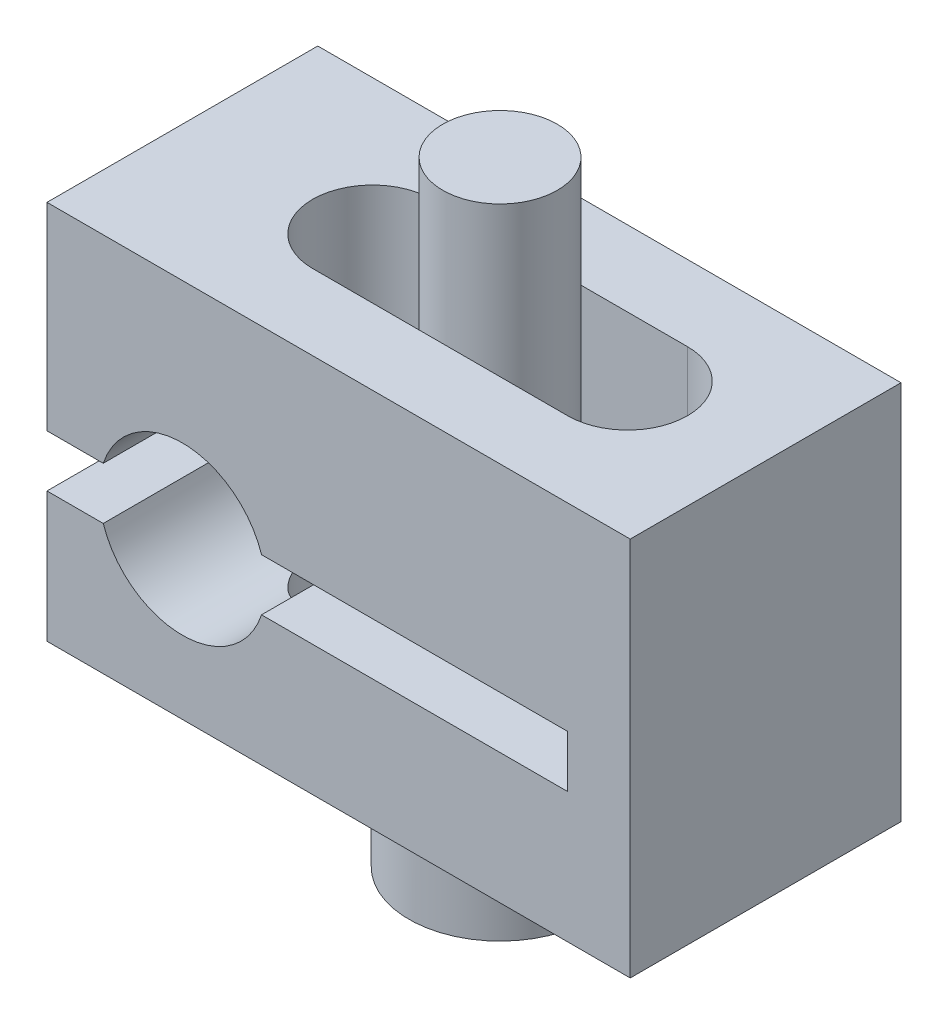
ISO-10303-21;
HEADER;
FILE_DESCRIPTION(('STEP AP214'),'2;1');
FILE_NAME('part.step','',(''),(''),'','','');
FILE_SCHEMA(('AUTOMOTIVE_DESIGN { 1 0 10303 214 1 1 1 1 }'));
ENDSEC;
DATA;
#1=APPLICATION_CONTEXT('core data for automotive mechanical design processes');
#2=APPLICATION_PROTOCOL_DEFINITION('international standard','automotive_design',2000,#1);
#3=PRODUCT_CONTEXT('',#1,'mechanical');
#4=PRODUCT('Part','Part','',(#3));
#5=PRODUCT_RELATED_PRODUCT_CATEGORY('part','',(#4));
#6=PRODUCT_DEFINITION_FORMATION('','',#4);
#7=PRODUCT_DEFINITION_CONTEXT('part definition',#1,'design');
#8=PRODUCT_DEFINITION('design','',#6,#7);
#9=PRODUCT_DEFINITION_SHAPE('','',#8);
#10=(LENGTH_UNIT() NAMED_UNIT(*) SI_UNIT(.MILLI.,.METRE.));
#11=(NAMED_UNIT(*) PLANE_ANGLE_UNIT() SI_UNIT($,.RADIAN.));
#12=(NAMED_UNIT(*) SI_UNIT($,.STERADIAN.) SOLID_ANGLE_UNIT());
#13=UNCERTAINTY_MEASURE_WITH_UNIT(LENGTH_MEASURE(1.E-05),#10,'distance_accuracy_value','');
#14=(GEOMETRIC_REPRESENTATION_CONTEXT(3) GLOBAL_UNCERTAINTY_ASSIGNED_CONTEXT((#13)) GLOBAL_UNIT_ASSIGNED_CONTEXT((#10,
#11,#12)) REPRESENTATION_CONTEXT('',''));
#15=CARTESIAN_POINT('',(0.,0.,0.));
#16=DIRECTION('',(0.,0.,1.));
#17=DIRECTION('',(1.,0.,0.));
#18=AXIS2_PLACEMENT_3D('',#15,#16,#17);
#19=CARTESIAN_POINT('',(0.634999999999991,-5.96900000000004,0.));
#20=DIRECTION('',(0.,1.,0.));
#21=DIRECTION('',(0.,0.,1.));
#22=AXIS2_PLACEMENT_3D('',#19,#20,#21);
#23=PLANE('',#22);
#24=DIRECTION('',(1.,0.,0.));
#25=VECTOR('',#24,1.);
#26=CARTESIAN_POINT('',(1.26999999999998,-5.96900000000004,1.09985226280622));
#27=LINE('',#26,#25);
#28=CARTESIAN_POINT('',(1.26999999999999,-5.96900000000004,1.09985226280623));
#29=VERTEX_POINT('',#28);
#30=CARTESIAN_POINT('',(0.,-5.96900000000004,1.09985226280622));
#31=VERTEX_POINT('',#30);
#32=EDGE_CURVE('E300',#29,#31,#27,.F.);
#33=ORIENTED_EDGE('',*,*,#32,.T.);
#34=DIRECTION('',(0.500000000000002,0.,0.866025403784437));
#35=VECTOR('',#34,1.);
#36=CARTESIAN_POINT('',(0.,-5.96900000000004,1.09985226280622));
#37=LINE('',#36,#35);
#38=CARTESIAN_POINT('',(-0.634999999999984,-5.96900000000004,0.));
#39=VERTEX_POINT('',#38);
#40=EDGE_CURVE('E630',#31,#39,#37,.F.);
#41=ORIENTED_EDGE('',*,*,#40,.T.);
#42=DIRECTION('',(-0.5,0.,0.866025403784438));
#43=VECTOR('',#42,1.);
#44=CARTESIAN_POINT('',(-0.634999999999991,-5.96900000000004,0.));
#45=LINE('',#44,#43);
#46=CARTESIAN_POINT('',(0.,-5.96900000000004,-1.09985226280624));
#47=VERTEX_POINT('',#46);
#48=EDGE_CURVE('E625',#39,#47,#45,.F.);
#49=ORIENTED_EDGE('',*,*,#48,.T.);
#50=DIRECTION('',(-1.,0.,0.));
#51=VECTOR('',#50,1.);
#52=CARTESIAN_POINT('',(0.,-5.96900000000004,-1.09985226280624));
#53=LINE('',#52,#51);
#54=CARTESIAN_POINT('',(1.26999999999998,-5.96900000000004,-1.09985226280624));
#55=VERTEX_POINT('',#54);
#56=EDGE_CURVE('E620',#47,#55,#53,.F.);
#57=ORIENTED_EDGE('',*,*,#56,.T.);
#58=DIRECTION('',(-0.500000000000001,0.,-0.866025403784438));
#59=VECTOR('',#58,1.);
#60=CARTESIAN_POINT('',(1.26999999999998,-5.96900000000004,-1.09985226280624));
#61=LINE('',#60,#59);
#62=CARTESIAN_POINT('',(1.90499999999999,-5.96900000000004,0.));
#63=VERTEX_POINT('',#62);
#64=EDGE_CURVE('E150',#55,#63,#61,.F.);
#65=ORIENTED_EDGE('',*,*,#64,.T.);
#66=DIRECTION('',(0.5,0.,-0.866025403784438));
#67=VECTOR('',#66,1.);
#68=CARTESIAN_POINT('',(1.905,-5.96900000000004,0.));
#69=LINE('',#68,#67);
#70=EDGE_CURVE('E615',#63,#29,#69,.F.);
#71=ORIENTED_EDGE('',*,*,#70,.T.);
#72=EDGE_LOOP('',(#33,#41,#49,#57,#65,#71));
#73=FACE_BOUND('',#72,.T.);
#74=ADVANCED_FACE('F17',(#73),#23,.F.);
#75=CARTESIAN_POINT('',(0.50800000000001,7.49299999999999,0.));
#76=DIRECTION('',(0.,1.,0.));
#77=DIRECTION('',(0.,0.,1.));
#78=AXIS2_PLACEMENT_3D('',#75,#76,#77);
#79=PLANE('',#78);
#80=CARTESIAN_POINT('',(0.634999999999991,7.49299999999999,0.));
#81=DIRECTION('',(0.,-1.,0.));
#82=DIRECTION('',(0.,0.,-1.));
#83=AXIS2_PLACEMENT_3D('',#80,#81,#82);
#84=CIRCLE('',#83,1.397);
#85=CARTESIAN_POINT('',(0.634999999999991,7.49299999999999,-1.39699999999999));
#86=VERTEX_POINT('',#85);
#87=EDGE_CURVE('E22',#86,#86,#84,.T.);
#88=ORIENTED_EDGE('',*,*,#87,.F.);
#89=EDGE_LOOP('',(#88));
#90=FACE_BOUND('',#89,.T.);
#91=ADVANCED_FACE('F811',(#90),#79,.T.);
#92=CARTESIAN_POINT('',(-2.47649999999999,4.318,1.4605));
#93=DIRECTION('',(0.,0.,1.));
#94=DIRECTION('',(1.,0.,0.));
#95=AXIS2_PLACEMENT_3D('',#92,#93,#94);
#96=PLANE('',#95);
#97=CARTESIAN_POINT('',(-3.80999999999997,-1.14300000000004,1.4605));
#98=DIRECTION('',(0.,0.,-1.));
#99=DIRECTION('',(0.,1.,0.));
#100=AXIS2_PLACEMENT_3D('',#97,#98,#99);
#101=CIRCLE('',#100,2.032);
#102=CARTESIAN_POINT('',(-1.87976711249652,-0.507999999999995,1.4605));
#103=VERTEX_POINT('',#102);
#104=CARTESIAN_POINT('',(-2.47649999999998,0.390232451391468,1.4605));
#105=VERTEX_POINT('',#104);
#106=EDGE_CURVE('E403',#103,#105,#101,.F.);
#107=ORIENTED_EDGE('',*,*,#106,.T.);
#108=DIRECTION('',(0.,-1.,0.));
#109=VECTOR('',#108,1.);
#110=CARTESIAN_POINT('',(-2.47649999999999,4.318,1.46050000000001));
#111=LINE('',#110,#109);
#112=CARTESIAN_POINT('',(-2.47649999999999,4.318,1.46050000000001));
#113=VERTEX_POINT('',#112);
#114=EDGE_CURVE('E303',#105,#113,#111,.F.);
#115=ORIENTED_EDGE('',*,*,#114,.T.);
#116=DIRECTION('',(1.,0.,0.));
#117=VECTOR('',#116,1.);
#118=CARTESIAN_POINT('',(7.11199999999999,4.318,1.4605));
#119=LINE('',#118,#117);
#120=CARTESIAN_POINT('',(3.7465,4.318,1.46050000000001));
#121=VERTEX_POINT('',#120);
#122=EDGE_CURVE('E289',#121,#113,#119,.F.);
#123=ORIENTED_EDGE('',*,*,#122,.F.);
#124=DIRECTION('',(0.,-1.,0.));
#125=VECTOR('',#124,1.);
#126=CARTESIAN_POINT('',(3.7465,4.318,1.46050000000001));
#127=LINE('',#126,#125);
#128=CARTESIAN_POINT('',(3.7465,-0.507999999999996,1.4605));
#129=VERTEX_POINT('',#128);
#130=EDGE_CURVE('E297',#121,#129,#127,.T.);
#131=ORIENTED_EDGE('',*,*,#130,.T.);
#132=DIRECTION('',(1.,0.,0.));
#133=VECTOR('',#132,1.);
#134=CARTESIAN_POINT('',(-1.87976711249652,-0.507999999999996,1.4605));
#135=LINE('',#134,#133);
#136=EDGE_CURVE('E543',#103,#129,#135,.T.);
#137=ORIENTED_EDGE('',*,*,#136,.F.);
#138=EDGE_LOOP('',(#107,#115,#123,#131,#137));
#139=FACE_BOUND('',#138,.T.);
#140=ADVANCED_FACE('F603',(#139),#96,.F.);
#141=CARTESIAN_POINT('',(-2.47649999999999,4.318,0.));
#142=DIRECTION('',(0.,-1.,0.));
#143=DIRECTION('',(0.,0.,-1.));
#144=AXIS2_PLACEMENT_3D('',#141,#142,#143);
#145=CYLINDRICAL_SURFACE('',#144,1.4605);
#146=CARTESIAN_POINT('',(-2.47649999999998,0.390232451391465,1.46050000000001));
#147=CARTESIAN_POINT('',(-2.50555463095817,0.415509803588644,1.46050207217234));
#148=CARTESIAN_POINT('',(-2.53534390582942,0.439959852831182,1.45963267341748));
#149=CARTESIAN_POINT('',(-2.59620579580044,0.487093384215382,1.45590518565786));
#150=CARTESIAN_POINT('',(-2.62727943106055,0.509775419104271,1.45304548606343));
#151=CARTESIAN_POINT('',(-2.69055768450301,0.553275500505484,1.44508061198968));
#152=CARTESIAN_POINT('',(-2.7227650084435,0.574088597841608,1.439969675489));
#153=CARTESIAN_POINT('',(-2.78792788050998,0.61365858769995,1.42729725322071));
#154=CARTESIAN_POINT('',(-2.820883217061,0.632416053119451,1.41973645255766));
#155=CARTESIAN_POINT('',(-2.92077758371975,0.685657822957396,1.39299130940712));
#156=CARTESIAN_POINT('',(-2.98845267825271,0.716912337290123,1.36977657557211));
#157=CARTESIAN_POINT('',(-3.1222658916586,0.770437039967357,1.31200058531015));
#158=CARTESIAN_POINT('',(-3.18840724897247,0.792728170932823,1.27746612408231));
#159=CARTESIAN_POINT('',(-3.31096528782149,0.827717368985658,1.20063972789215));
#160=CARTESIAN_POINT('',(-3.3677364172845,0.841041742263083,1.15919277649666));
#161=CARTESIAN_POINT('',(-3.47531586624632,0.861999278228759,1.06790025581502));
#162=CARTESIAN_POINT('',(-3.52611851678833,0.869627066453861,1.01804680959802));
#163=CARTESIAN_POINT('',(-3.6213233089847,0.880805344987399,0.909819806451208));
#164=CARTESIAN_POINT('',(-3.66552285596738,0.884243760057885,0.851257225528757));
#165=CARTESIAN_POINT('',(-3.74469371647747,0.888338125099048,0.728086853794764));
#166=CARTESIAN_POINT('',(-3.77965984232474,0.888992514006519,0.663475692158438));
#167=CARTESIAN_POINT('',(-3.84207606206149,0.889008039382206,0.524012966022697));
#168=CARTESIAN_POINT('',(-3.868625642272,0.888253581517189,0.448758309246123));
#169=CARTESIAN_POINT('',(-3.90908942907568,0.886684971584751,0.295033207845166));
#170=CARTESIAN_POINT('',(-3.92302794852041,0.88587093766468,0.21656925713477));
#171=CARTESIAN_POINT('',(-3.93266911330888,0.885294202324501,0.114724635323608));
#172=CARTESIAN_POINT('',(-3.93429216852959,0.8851954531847,0.0918120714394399));
#173=CARTESIAN_POINT('',(-3.93645805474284,0.885061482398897,0.0459363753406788));
#174=CARTESIAN_POINT('',(-3.93700090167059,0.885026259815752,0.0229732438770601));
#175=CARTESIAN_POINT('',(-3.93699678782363,0.885031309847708,-0.0818370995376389));
#176=CARTESIAN_POINT('',(-3.93009275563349,0.885496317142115,-0.16379125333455));
#177=CARTESIAN_POINT('',(-3.90263419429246,0.886932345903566,-0.325508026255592));
#178=CARTESIAN_POINT('',(-3.88204779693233,0.887904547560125,-0.405265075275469));
#179=CARTESIAN_POINT('',(-3.82779059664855,0.889102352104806,-0.560179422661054));
#180=CARTESIAN_POINT('',(-3.79412638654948,0.889328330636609,-0.635339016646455));
#181=CARTESIAN_POINT('',(-3.71468713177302,0.887150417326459,-0.778895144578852));
#182=CARTESIAN_POINT('',(-3.66891788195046,0.884747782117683,-0.847294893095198));
#183=CARTESIAN_POINT('',(-3.56747671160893,0.875107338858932,-0.974339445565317));
#184=CARTESIAN_POINT('',(-3.51195828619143,0.867940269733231,-1.03311151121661));
#185=CARTESIAN_POINT('',(-3.3927568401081,0.846617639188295,-1.14014620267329));
#186=CARTESIAN_POINT('',(-3.32908137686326,0.832468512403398,-1.18841844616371));
#187=CARTESIAN_POINT('',(-3.20191282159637,0.796910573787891,-1.26967310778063));
#188=CARTESIAN_POINT('',(-3.13881598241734,0.776176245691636,-1.30357226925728));
#189=CARTESIAN_POINT('',(-3.01107667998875,0.726607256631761,-1.36095188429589));
#190=CARTESIAN_POINT('',(-2.94643403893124,0.697771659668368,-1.38443113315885));
#191=CARTESIAN_POINT('',(-2.82126685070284,0.633560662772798,-1.42065551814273));
#192=CARTESIAN_POINT('',(-2.76068635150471,0.598529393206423,-1.43382802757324));
#193=CARTESIAN_POINT('',(-2.64274771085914,0.521778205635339,-1.45223333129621));
#194=CARTESIAN_POINT('',(-2.5853866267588,0.480064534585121,-1.45747349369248));
#195=CARTESIAN_POINT('',(-2.51213255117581,0.4206888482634,-1.46017998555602));
#196=CARTESIAN_POINT('',(-2.4941761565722,0.405611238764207,-1.4605018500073));
#197=CARTESIAN_POINT('',(-2.47649999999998,0.390232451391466,-1.46049999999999));
#198=B_SPLINE_CURVE_WITH_KNOTS('',3,(#146,#147,#148,#149,#150,#151,#152,#153,#154,#155,#156,
#157,#158,#159,#160,#161,#162,#163,#164,#165,#166,#167,#168,#169,#170,#171,#172,#173,#174,#175,
#176,#177,#178,#179,#180,#181,#182,#183,#184,#185,#186,#187,#188,#189,#190,#191,#192,#193,#194,
#195,#196,#197),.UNSPECIFIED.,.F.,.F.,(4,2,2,2,2,2,2,2,2,2,2,2,2,2,2,2,2,2,2,2,2,2,2,2,2,4),(0.,
0.115524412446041,0.231142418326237,0.34705808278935,0.462941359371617,0.695758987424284,
0.928029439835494,1.14165945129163,1.35549075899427,1.57492511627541,1.79448249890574,
2.03284914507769,2.27075525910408,2.33964860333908,2.40854093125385,2.65396781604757,
2.8999683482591,3.14584502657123,3.39160421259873,3.63379368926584,3.87576038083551,
4.09828962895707,4.3208445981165,4.53359358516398,4.74614483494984,4.81646215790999),.UNSPECIFIED.);
#199=CARTESIAN_POINT('',(-2.47649999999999,0.390232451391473,-1.4605));
#200=VERTEX_POINT('',#199);
#201=EDGE_CURVE('E226',#105,#200,#198,.T.);
#202=ORIENTED_EDGE('',*,*,#201,.T.);
#203=DIRECTION('',(0.,1.,0.));
#204=VECTOR('',#203,1.);
#205=CARTESIAN_POINT('',(-2.47649999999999,4.318,-1.4605));
#206=LINE('',#205,#204);
#207=CARTESIAN_POINT('',(-2.47649999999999,4.318,-1.46049999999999));
#208=VERTEX_POINT('',#207);
#209=EDGE_CURVE('E302',#200,#208,#206,.T.);
#210=ORIENTED_EDGE('',*,*,#209,.T.);
#211=CARTESIAN_POINT('',(-2.47649999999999,4.318,0.));
#212=DIRECTION('',(0.,-1.,0.));
#213=DIRECTION('',(0.,0.,-1.));
#214=AXIS2_PLACEMENT_3D('',#211,#212,#213);
#215=CIRCLE('',#214,1.4605);
#216=EDGE_CURVE('E418',#113,#208,#215,.T.);
#217=ORIENTED_EDGE('',*,*,#216,.F.);
#218=ORIENTED_EDGE('',*,*,#114,.F.);
#219=EDGE_LOOP('',(#202,#210,#217,#218));
#220=FACE_BOUND('',#219,.T.);
#221=ADVANCED_FACE('F428',(#220),#145,.F.);
#222=CARTESIAN_POINT('',(3.7465,4.318,-1.4605));
#223=DIRECTION('',(0.,0.,-1.));
#224=DIRECTION('',(-1.,0.,0.));
#225=AXIS2_PLACEMENT_3D('',#222,#223,#224);
#226=PLANE('',#225);
#227=DIRECTION('',(0.,-1.,0.));
#228=VECTOR('',#227,1.);
#229=CARTESIAN_POINT('',(3.7465,4.318,-1.46049999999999));
#230=LINE('',#229,#228);
#231=CARTESIAN_POINT('',(3.7465,-0.507999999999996,-1.4605));
#232=VERTEX_POINT('',#231);
#233=CARTESIAN_POINT('',(3.7465,4.318,-1.46049999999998));
#234=VERTEX_POINT('',#233);
#235=EDGE_CURVE('E138',#232,#234,#230,.F.);
#236=ORIENTED_EDGE('',*,*,#235,.T.);
#237=DIRECTION('',(1.,0.,0.));
#238=VECTOR('',#237,1.);
#239=CARTESIAN_POINT('',(7.11199999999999,4.318,-1.46049999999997));
#240=LINE('',#239,#238);
#241=EDGE_CURVE('E532',#208,#234,#240,.T.);
#242=ORIENTED_EDGE('',*,*,#241,.F.);
#243=ORIENTED_EDGE('',*,*,#209,.F.);
#244=CARTESIAN_POINT('',(-3.80999999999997,-1.14300000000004,-1.46049999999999));
#245=DIRECTION('',(0.,0.,-1.));
#246=DIRECTION('',(0.,1.,0.));
#247=AXIS2_PLACEMENT_3D('',#244,#245,#246);
#248=CIRCLE('',#247,2.032);
#249=CARTESIAN_POINT('',(-1.87976711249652,-0.507999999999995,-1.4605));
#250=VERTEX_POINT('',#249);
#251=EDGE_CURVE('E276',#200,#250,#248,.T.);
#252=ORIENTED_EDGE('',*,*,#251,.T.);
#253=DIRECTION('',(1.,0.,0.));
#254=VECTOR('',#253,1.);
#255=CARTESIAN_POINT('',(-1.87976711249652,-0.507999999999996,-1.46050000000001));
#256=LINE('',#255,#254);
#257=EDGE_CURVE('E227',#232,#250,#256,.F.);
#258=ORIENTED_EDGE('',*,*,#257,.F.);
#259=EDGE_LOOP('',(#236,#242,#243,#252,#258));
#260=FACE_BOUND('',#259,.T.);
#261=ADVANCED_FACE('F606',(#260),#226,.F.);
#262=CARTESIAN_POINT('',(3.7465,4.318,0.));
#263=DIRECTION('',(0.,-1.,0.));
#264=DIRECTION('',(0.,0.,-1.));
#265=AXIS2_PLACEMENT_3D('',#262,#263,#264);
#266=CYLINDRICAL_SURFACE('',#265,1.4605);
#267=CARTESIAN_POINT('',(3.7465,-0.507999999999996,0.));
#268=DIRECTION('',(0.,-1.,0.));
#269=DIRECTION('',(0.,0.,-1.));
#270=AXIS2_PLACEMENT_3D('',#267,#268,#269);
#271=CIRCLE('',#270,1.4605);
#272=EDGE_CURVE('E141',#129,#232,#271,.F.);
#273=ORIENTED_EDGE('',*,*,#272,.F.);
#274=ORIENTED_EDGE('',*,*,#130,.F.);
#275=CARTESIAN_POINT('',(3.7465,4.318,0.));
#276=DIRECTION('',(0.,-1.,0.));
#277=DIRECTION('',(0.,0.,-1.));
#278=AXIS2_PLACEMENT_3D('',#275,#276,#277);
#279=CIRCLE('',#278,1.4605);
#280=EDGE_CURVE('E529',#234,#121,#279,.T.);
#281=ORIENTED_EDGE('',*,*,#280,.F.);
#282=ORIENTED_EDGE('',*,*,#235,.F.);
#283=EDGE_LOOP('',(#273,#274,#281,#282));
#284=FACE_BOUND('',#283,.T.);
#285=ADVANCED_FACE('F850',(#284),#266,.F.);
#286=CARTESIAN_POINT('',(1.26999999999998,-7.49299999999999,1.09985226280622));
#287=DIRECTION('',(0.,0.,1.));
#288=DIRECTION('',(1.,0.,0.));
#289=AXIS2_PLACEMENT_3D('',#286,#287,#288);
#290=PLANE('',#289);
#291=DIRECTION('',(0.,1.,0.));
#292=VECTOR('',#291,1.);
#293=CARTESIAN_POINT('',(1.27,-7.49299999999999,1.09985226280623));
#294=LINE('',#293,#292);
#295=CARTESIAN_POINT('',(1.26999999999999,-7.49299999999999,1.09985226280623));
#296=VERTEX_POINT('',#295);
#297=EDGE_CURVE('E609',#29,#296,#294,.F.);
#298=ORIENTED_EDGE('',*,*,#297,.T.);
#299=DIRECTION('',(1.,0.,0.));
#300=VECTOR('',#299,1.);
#301=CARTESIAN_POINT('',(0.432954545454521,-7.49299999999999,1.09985226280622));
#302=LINE('',#301,#300);
#303=CARTESIAN_POINT('',(0.,-7.49299999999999,1.09985226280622));
#304=VERTEX_POINT('',#303);
#305=EDGE_CURVE('E531',#296,#304,#302,.F.);
#306=ORIENTED_EDGE('',*,*,#305,.T.);
#307=DIRECTION('',(0.,1.,0.));
#308=VECTOR('',#307,1.);
#309=CARTESIAN_POINT('',(0.,-7.49299999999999,1.09985226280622));
#310=LINE('',#309,#308);
#311=EDGE_CURVE('E633',#304,#31,#310,.T.);
#312=ORIENTED_EDGE('',*,*,#311,.T.);
#313=ORIENTED_EDGE('',*,*,#32,.F.);
#314=EDGE_LOOP('',(#298,#306,#312,#313));
#315=FACE_BOUND('',#314,.T.);
#316=ADVANCED_FACE('F649',(#315),#290,.F.);
#317=CARTESIAN_POINT('',(0.,-7.49299999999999,1.09985226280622));
#318=DIRECTION('',(-0.866025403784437,0.,0.500000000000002));
#319=DIRECTION('',(0.500000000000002,0.,0.866025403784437));
#320=AXIS2_PLACEMENT_3D('',#317,#318,#319);
#321=PLANE('',#320);
#322=ORIENTED_EDGE('',*,*,#311,.F.);
#323=DIRECTION('',(-0.500000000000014,0.,-0.866025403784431));
#324=VECTOR('',#323,1.);
#325=CARTESIAN_POINT('',(0.,-7.49299999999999,1.09985226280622));
#326=LINE('',#325,#324);
#327=CARTESIAN_POINT('',(-0.634999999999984,-7.49299999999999,0.));
#328=VERTEX_POINT('',#327);
#329=EDGE_CURVE('E537',#304,#328,#326,.T.);
#330=ORIENTED_EDGE('',*,*,#329,.T.);
#331=DIRECTION('',(0.,1.,0.));
#332=VECTOR('',#331,1.);
#333=CARTESIAN_POINT('',(-0.634999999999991,-7.49299999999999,0.));
#334=LINE('',#333,#332);
#335=EDGE_CURVE('E627',#328,#39,#334,.T.);
#336=ORIENTED_EDGE('',*,*,#335,.T.);
#337=ORIENTED_EDGE('',*,*,#40,.F.);
#338=EDGE_LOOP('',(#322,#330,#336,#337));
#339=FACE_BOUND('',#338,.T.);
#340=ADVANCED_FACE('F647',(#339),#321,.F.);
#341=CARTESIAN_POINT('',(-0.634999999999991,-7.49299999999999,0.));
#342=DIRECTION('',(-0.866025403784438,0.,-0.5));
#343=DIRECTION('',(-0.5,0.,0.866025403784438));
#344=AXIS2_PLACEMENT_3D('',#341,#342,#343);
#345=PLANE('',#344);
#346=ORIENTED_EDGE('',*,*,#335,.F.);
#347=DIRECTION('',(0.500000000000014,0.,-0.866025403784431));
#348=VECTOR('',#347,1.);
#349=CARTESIAN_POINT('',(-0.634999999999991,-7.49299999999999,0.));
#350=LINE('',#349,#348);
#351=CARTESIAN_POINT('',(0.,-7.49299999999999,-1.09985226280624));
#352=VERTEX_POINT('',#351);
#353=EDGE_CURVE('E554',#328,#352,#350,.T.);
#354=ORIENTED_EDGE('',*,*,#353,.T.);
#355=DIRECTION('',(0.,1.,0.));
#356=VECTOR('',#355,1.);
#357=CARTESIAN_POINT('',(0.,-7.49299999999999,-1.09985226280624));
#358=LINE('',#357,#356);
#359=EDGE_CURVE('E622',#352,#47,#358,.T.);
#360=ORIENTED_EDGE('',*,*,#359,.T.);
#361=ORIENTED_EDGE('',*,*,#48,.F.);
#362=EDGE_LOOP('',(#346,#354,#360,#361));
#363=FACE_BOUND('',#362,.T.);
#364=ADVANCED_FACE('F656',(#363),#345,.F.);
#365=CARTESIAN_POINT('',(0.,-7.49299999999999,-1.09985226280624));
#366=DIRECTION('',(0.,0.,-1.));
#367=DIRECTION('',(-1.,0.,0.));
#368=AXIS2_PLACEMENT_3D('',#365,#366,#367);
#369=PLANE('',#368);
#370=ORIENTED_EDGE('',*,*,#359,.F.);
#371=DIRECTION('',(1.,0.,0.));
#372=VECTOR('',#371,1.);
#373=CARTESIAN_POINT('',(0.432954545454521,-7.49299999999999,-1.09985226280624));
#374=LINE('',#373,#372);
#375=CARTESIAN_POINT('',(1.26999999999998,-7.49299999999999,-1.09985226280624));
#376=VERTEX_POINT('',#375);
#377=EDGE_CURVE('E551',#352,#376,#374,.T.);
#378=ORIENTED_EDGE('',*,*,#377,.T.);
#379=DIRECTION('',(0.,1.,0.));
#380=VECTOR('',#379,1.);
#381=CARTESIAN_POINT('',(1.26999999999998,-7.49299999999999,-1.09985226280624));
#382=LINE('',#381,#380);
#383=EDGE_CURVE('E617',#376,#55,#382,.T.);
#384=ORIENTED_EDGE('',*,*,#383,.T.);
#385=ORIENTED_EDGE('',*,*,#56,.F.);
#386=EDGE_LOOP('',(#370,#378,#384,#385));
#387=FACE_BOUND('',#386,.T.);
#388=ADVANCED_FACE('F661',(#387),#369,.F.);
#389=CARTESIAN_POINT('',(1.26999999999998,-7.49299999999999,-1.09985226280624));
#390=DIRECTION('',(0.866025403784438,0.,-0.500000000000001));
#391=DIRECTION('',(-0.500000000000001,0.,-0.866025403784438));
#392=AXIS2_PLACEMENT_3D('',#389,#390,#391);
#393=PLANE('',#392);
#394=ORIENTED_EDGE('',*,*,#383,.F.);
#395=DIRECTION('',(0.500000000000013,0.,0.866025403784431));
#396=VECTOR('',#395,1.);
#397=CARTESIAN_POINT('',(1.26999999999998,-7.49299999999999,-1.09985226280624));
#398=LINE('',#397,#396);
#399=CARTESIAN_POINT('',(1.90499999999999,-7.49299999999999,0.));
#400=VERTEX_POINT('',#399);
#401=EDGE_CURVE('E548',#376,#400,#398,.T.);
#402=ORIENTED_EDGE('',*,*,#401,.T.);
#403=DIRECTION('',(0.,1.,0.));
#404=VECTOR('',#403,1.);
#405=CARTESIAN_POINT('',(1.905,-7.49299999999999,0.));
#406=LINE('',#405,#404);
#407=EDGE_CURVE('E612',#400,#63,#406,.T.);
#408=ORIENTED_EDGE('',*,*,#407,.T.);
#409=ORIENTED_EDGE('',*,*,#64,.F.);
#410=EDGE_LOOP('',(#394,#402,#408,#409));
#411=FACE_BOUND('',#410,.T.);
#412=ADVANCED_FACE('F663',(#411),#393,.F.);
#413=CARTESIAN_POINT('',(1.905,-7.49299999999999,0.));
#414=DIRECTION('',(0.866025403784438,0.,0.5));
#415=DIRECTION('',(0.5,0.,-0.866025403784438));
#416=AXIS2_PLACEMENT_3D('',#413,#414,#415);
#417=PLANE('',#416);
#418=ORIENTED_EDGE('',*,*,#407,.F.);
#419=DIRECTION('',(-0.500000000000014,0.,0.866025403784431));
#420=VECTOR('',#419,1.);
#421=CARTESIAN_POINT('',(1.905,-7.49299999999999,0.));
#422=LINE('',#421,#420);
#423=EDGE_CURVE('E253',#400,#296,#422,.T.);
#424=ORIENTED_EDGE('',*,*,#423,.T.);
#425=ORIENTED_EDGE('',*,*,#297,.F.);
#426=ORIENTED_EDGE('',*,*,#70,.F.);
#427=EDGE_LOOP('',(#418,#424,#425,#426));
#428=FACE_BOUND('',#427,.T.);
#429=ADVANCED_FACE('F665',(#428),#417,.F.);
#430=CARTESIAN_POINT('',(0.634999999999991,7.49299999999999,0.));
#431=DIRECTION('',(0.,-1.,0.));
#432=DIRECTION('',(0.,0.,-1.));
#433=AXIS2_PLACEMENT_3D('',#430,#431,#432);
#434=CYLINDRICAL_SURFACE('',#433,1.397);
#435=ORIENTED_EDGE('',*,*,#87,.T.);
#436=EDGE_LOOP('',(#435));
#437=FACE_BOUND('',#436,.T.);
#438=CARTESIAN_POINT('',(0.634999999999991,-4.953,0.));
#439=DIRECTION('',(0.,-1.,0.));
#440=DIRECTION('',(0.,0.,-1.));
#441=AXIS2_PLACEMENT_3D('',#438,#439,#440);
#442=CIRCLE('',#441,1.397);
#443=CARTESIAN_POINT('',(0.634999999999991,-4.953,-1.397));
#444=VERTEX_POINT('',#443);
#445=EDGE_CURVE('E252',#444,#444,#442,.T.);
#446=ORIENTED_EDGE('',*,*,#445,.F.);
#447=EDGE_LOOP('',(#446));
#448=FACE_BOUND('',#447,.T.);
#449=ADVANCED_FACE('F667',(#437,#448),#434,.T.);
#450=CARTESIAN_POINT('',(5.58799999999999,-0.507999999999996,3.30199999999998));
#451=DIRECTION('',(-1.,0.,0.));
#452=DIRECTION('',(0.,0.,1.));
#453=AXIS2_PLACEMENT_3D('',#450,#451,#452);
#454=PLANE('',#453);
#455=DIRECTION('',(0.,1.,0.));
#456=VECTOR('',#455,1.);
#457=CARTESIAN_POINT('',(5.58799999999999,-0.624782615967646,3.30199999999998));
#458=LINE('',#457,#456);
#459=CARTESIAN_POINT('',(5.58799999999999,-1.77800000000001,3.30199999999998));
#460=VERTEX_POINT('',#459);
#461=CARTESIAN_POINT('',(5.58799999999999,-0.507999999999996,3.30199999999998));
#462=VERTEX_POINT('',#461);
#463=EDGE_CURVE('E234',#460,#462,#458,.T.);
#464=ORIENTED_EDGE('',*,*,#463,.T.);
#465=DIRECTION('',(0.,0.,-1.));
#466=VECTOR('',#465,1.);
#467=CARTESIAN_POINT('',(5.58799999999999,-0.507999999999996,3.30199999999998));
#468=LINE('',#467,#466);
#469=CARTESIAN_POINT('',(5.58799999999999,-0.507999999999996,-3.302));
#470=VERTEX_POINT('',#469);
#471=EDGE_CURVE('E216',#470,#462,#468,.F.);
#472=ORIENTED_EDGE('',*,*,#471,.F.);
#473=DIRECTION('',(0.,1.,0.));
#474=VECTOR('',#473,1.);
#475=CARTESIAN_POINT('',(5.58799999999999,-0.624782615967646,-3.302));
#476=LINE('',#475,#474);
#477=CARTESIAN_POINT('',(5.58799999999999,-1.77800000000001,-3.302));
#478=VERTEX_POINT('',#477);
#479=EDGE_CURVE('E277',#478,#470,#476,.T.);
#480=ORIENTED_EDGE('',*,*,#479,.F.);
#481=DIRECTION('',(0.,0.,1.));
#482=VECTOR('',#481,1.);
#483=CARTESIAN_POINT('',(5.58799999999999,-1.77800000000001,3.30199999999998));
#484=LINE('',#483,#482);
#485=EDGE_CURVE('E241',#460,#478,#484,.F.);
#486=ORIENTED_EDGE('',*,*,#485,.F.);
#487=EDGE_LOOP('',(#464,#472,#480,#486));
#488=FACE_BOUND('',#487,.T.);
#489=ADVANCED_FACE('F240',(#488),#454,.T.);
#490=CARTESIAN_POINT('',(-1.87976711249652,-0.507999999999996,3.30199999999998));
#491=DIRECTION('',(0.,-1.,0.));
#492=DIRECTION('',(0.,0.,-1.));
#493=AXIS2_PLACEMENT_3D('',#490,#491,#492);
#494=PLANE('',#493);
#495=DIRECTION('',(-1.,0.,0.));
#496=VECTOR('',#495,1.);
#497=CARTESIAN_POINT('',(-0.168472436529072,-0.507999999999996,3.30199999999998));
#498=LINE('',#497,#496);
#499=CARTESIAN_POINT('',(-1.87976711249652,-0.507999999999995,3.30199999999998));
#500=VERTEX_POINT('',#499);
#501=EDGE_CURVE('E220',#462,#500,#498,.T.);
#502=ORIENTED_EDGE('',*,*,#501,.T.);
#503=DIRECTION('',(0.,0.,-1.));
#504=VECTOR('',#503,1.);
#505=CARTESIAN_POINT('',(-1.87976711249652,-0.507999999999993,3.30199999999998));
#506=LINE('',#505,#504);
#507=EDGE_CURVE('E275',#500,#103,#506,.T.);
#508=ORIENTED_EDGE('',*,*,#507,.T.);
#509=ORIENTED_EDGE('',*,*,#136,.T.);
#510=ORIENTED_EDGE('',*,*,#272,.T.);
#511=ORIENTED_EDGE('',*,*,#257,.T.);
#512=DIRECTION('',(0.,0.,-1.));
#513=VECTOR('',#512,1.);
#514=CARTESIAN_POINT('',(-1.87976711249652,-0.507999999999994,3.30199999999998));
#515=LINE('',#514,#513);
#516=CARTESIAN_POINT('',(-1.87976711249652,-0.507999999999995,-3.302));
#517=VERTEX_POINT('',#516);
#518=EDGE_CURVE('E273',#250,#517,#515,.T.);
#519=ORIENTED_EDGE('',*,*,#518,.T.);
#520=DIRECTION('',(-1.,0.,0.));
#521=VECTOR('',#520,1.);
#522=CARTESIAN_POINT('',(-0.168472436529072,-0.507999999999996,-3.302));
#523=LINE('',#522,#521);
#524=EDGE_CURVE('E222',#470,#517,#523,.T.);
#525=ORIENTED_EDGE('',*,*,#524,.F.);
#526=ORIENTED_EDGE('',*,*,#471,.T.);
#527=EDGE_LOOP('',(#502,#508,#509,#510,#511,#519,#525,#526));
#528=FACE_BOUND('',#527,.T.);
#529=ADVANCED_FACE('F218',(#528),#494,.T.);
#530=CARTESIAN_POINT('',(-3.80999999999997,-1.14300000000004,3.30199999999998));
#531=DIRECTION('',(0.,0.,-1.));
#532=DIRECTION('',(0.,1.,0.));
#533=AXIS2_PLACEMENT_3D('',#530,#531,#532);
#534=CYLINDRICAL_SURFACE('',#533,2.032);
#535=ORIENTED_EDGE('',*,*,#507,.F.);
#536=CARTESIAN_POINT('',(-3.80999999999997,-1.14300000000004,3.30199999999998));
#537=DIRECTION('',(0.,0.,-1.));
#538=DIRECTION('',(0.,1.,0.));
#539=AXIS2_PLACEMENT_3D('',#536,#537,#538);
#540=CIRCLE('',#539,2.032);
#541=CARTESIAN_POINT('',(-5.74023288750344,-0.507999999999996,3.30199999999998));
#542=VERTEX_POINT('',#541);
#543=EDGE_CURVE('E238',#500,#542,#540,.F.);
#544=ORIENTED_EDGE('',*,*,#543,.T.);
#545=DIRECTION('',(0.,0.,-1.));
#546=VECTOR('',#545,1.);
#547=CARTESIAN_POINT('',(-5.74023288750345,-0.507999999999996,3.30199999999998));
#548=LINE('',#547,#546);
#549=CARTESIAN_POINT('',(-5.74023288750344,-0.507999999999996,-3.302));
#550=VERTEX_POINT('',#549);
#551=EDGE_CURVE('E401',#550,#542,#548,.F.);
#552=ORIENTED_EDGE('',*,*,#551,.F.);
#553=CARTESIAN_POINT('',(-3.80999999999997,-1.14300000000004,-3.302));
#554=DIRECTION('',(0.,0.,-1.));
#555=DIRECTION('',(0.,1.,0.));
#556=AXIS2_PLACEMENT_3D('',#553,#554,#555);
#557=CIRCLE('',#556,2.032);
#558=EDGE_CURVE('E525',#517,#550,#557,.F.);
#559=ORIENTED_EDGE('',*,*,#558,.F.);
#560=ORIENTED_EDGE('',*,*,#518,.F.);
#561=ORIENTED_EDGE('',*,*,#251,.F.);
#562=ORIENTED_EDGE('',*,*,#201,.F.);
#563=ORIENTED_EDGE('',*,*,#106,.F.);
#564=EDGE_LOOP('',(#535,#544,#552,#559,#560,#561,#562,#563));
#565=FACE_BOUND('',#564,.T.);
#566=ADVANCED_FACE('F432',(#565),#534,.F.);
#567=CARTESIAN_POINT('',(-7.11199999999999,-0.507999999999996,3.30199999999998));
#568=DIRECTION('',(0.,-1.,0.));
#569=DIRECTION('',(0.,0.,-1.));
#570=AXIS2_PLACEMENT_3D('',#567,#568,#569);
#571=PLANE('',#570);
#572=DIRECTION('',(-1.,0.,0.));
#573=VECTOR('',#572,1.);
#574=CARTESIAN_POINT('',(-0.168472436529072,-0.507999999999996,3.30199999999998));
#575=LINE('',#574,#573);
#576=CARTESIAN_POINT('',(-7.112,-0.507999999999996,3.30199999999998));
#577=VERTEX_POINT('',#576);
#578=EDGE_CURVE('E406',#542,#577,#575,.T.);
#579=ORIENTED_EDGE('',*,*,#578,.T.);
#580=DIRECTION('',(0.,0.,1.));
#581=VECTOR('',#580,1.);
#582=CARTESIAN_POINT('',(-7.11199999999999,-0.507999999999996,3.302));
#583=LINE('',#582,#581);
#584=CARTESIAN_POINT('',(-7.112,-0.507999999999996,-3.302));
#585=VERTEX_POINT('',#584);
#586=EDGE_CURVE('E290',#585,#577,#583,.T.);
#587=ORIENTED_EDGE('',*,*,#586,.F.);
#588=DIRECTION('',(-1.,0.,0.));
#589=VECTOR('',#588,1.);
#590=CARTESIAN_POINT('',(-0.168472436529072,-0.507999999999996,-3.302));
#591=LINE('',#590,#589);
#592=EDGE_CURVE('E527',#550,#585,#591,.T.);
#593=ORIENTED_EDGE('',*,*,#592,.F.);
#594=ORIENTED_EDGE('',*,*,#551,.T.);
#595=EDGE_LOOP('',(#579,#587,#593,#594));
#596=FACE_BOUND('',#595,.T.);
#597=ADVANCED_FACE('F437',(#596),#571,.T.);
#598=CARTESIAN_POINT('',(-7.11199999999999,4.318,3.302));
#599=DIRECTION('',(-1.,0.,0.));
#600=DIRECTION('',(0.,0.,1.));
#601=AXIS2_PLACEMENT_3D('',#598,#599,#600);
#602=PLANE('',#601);
#603=DIRECTION('',(0.,1.,0.));
#604=VECTOR('',#603,1.);
#605=CARTESIAN_POINT('',(-7.11199999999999,-0.624782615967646,3.30199999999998));
#606=LINE('',#605,#604);
#607=CARTESIAN_POINT('',(-7.11199999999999,4.318,3.30199999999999));
#608=VERTEX_POINT('',#607);
#609=EDGE_CURVE('E308',#577,#608,#606,.T.);
#610=ORIENTED_EDGE('',*,*,#609,.T.);
#611=DIRECTION('',(0.,0.,1.));
#612=VECTOR('',#611,1.);
#613=CARTESIAN_POINT('',(-7.11199999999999,4.318,3.302));
#614=LINE('',#613,#612);
#615=CARTESIAN_POINT('',(-7.112,4.318,-3.302));
#616=VERTEX_POINT('',#615);
#617=EDGE_CURVE('E287',#616,#608,#614,.T.);
#618=ORIENTED_EDGE('',*,*,#617,.F.);
#619=DIRECTION('',(0.,1.,0.));
#620=VECTOR('',#619,1.);
#621=CARTESIAN_POINT('',(-7.11199999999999,-0.624782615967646,-3.302));
#622=LINE('',#621,#620);
#623=EDGE_CURVE('E268',#585,#616,#622,.T.);
#624=ORIENTED_EDGE('',*,*,#623,.F.);
#625=ORIENTED_EDGE('',*,*,#586,.T.);
#626=EDGE_LOOP('',(#610,#618,#624,#625));
#627=FACE_BOUND('',#626,.T.);
#628=ADVANCED_FACE('F442',(#627),#602,.T.);
#629=CARTESIAN_POINT('',(7.11199999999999,4.318,3.302));
#630=DIRECTION('',(0.,1.,0.));
#631=DIRECTION('',(0.,0.,1.));
#632=AXIS2_PLACEMENT_3D('',#629,#630,#631);
#633=PLANE('',#632);
#634=ORIENTED_EDGE('',*,*,#241,.T.);
#635=ORIENTED_EDGE('',*,*,#280,.T.);
#636=ORIENTED_EDGE('',*,*,#122,.T.);
#637=ORIENTED_EDGE('',*,*,#216,.T.);
#638=EDGE_LOOP('',(#634,#635,#636,#637));
#639=FACE_BOUND('',#638,.T.);
#640=DIRECTION('',(-1.,0.,0.));
#641=VECTOR('',#640,1.);
#642=CARTESIAN_POINT('',(-0.168472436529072,4.318,3.30199999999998));
#643=LINE('',#642,#641);
#644=CARTESIAN_POINT('',(7.11199999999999,4.318,3.302));
#645=VERTEX_POINT('',#644);
#646=EDGE_CURVE('E284',#608,#645,#643,.F.);
#647=ORIENTED_EDGE('',*,*,#646,.T.);
#648=DIRECTION('',(0.,0.,-1.));
#649=VECTOR('',#648,1.);
#650=CARTESIAN_POINT('',(7.11199999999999,4.318,3.30199999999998));
#651=LINE('',#650,#649);
#652=CARTESIAN_POINT('',(7.11199999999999,4.318,-3.302));
#653=VERTEX_POINT('',#652);
#654=EDGE_CURVE('E574',#653,#645,#651,.F.);
#655=ORIENTED_EDGE('',*,*,#654,.F.);
#656=DIRECTION('',(-1.,0.,0.));
#657=VECTOR('',#656,1.);
#658=CARTESIAN_POINT('',(-0.168472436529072,4.318,-3.302));
#659=LINE('',#658,#657);
#660=EDGE_CURVE('E270',#616,#653,#659,.F.);
#661=ORIENTED_EDGE('',*,*,#660,.F.);
#662=ORIENTED_EDGE('',*,*,#617,.T.);
#663=EDGE_LOOP('',(#647,#655,#661,#662));
#664=FACE_BOUND('',#663,.T.);
#665=ADVANCED_FACE('F446',(#639,#664),#633,.T.);
#666=CARTESIAN_POINT('',(0.432954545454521,-7.49299999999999,0.));
#667=DIRECTION('',(0.,1.,0.));
#668=DIRECTION('',(0.,0.,1.));
#669=AXIS2_PLACEMENT_3D('',#666,#667,#668);
#670=PLANE('',#669);
#671=ORIENTED_EDGE('',*,*,#401,.F.);
#672=ORIENTED_EDGE('',*,*,#377,.F.);
#673=ORIENTED_EDGE('',*,*,#353,.F.);
#674=ORIENTED_EDGE('',*,*,#329,.F.);
#675=ORIENTED_EDGE('',*,*,#305,.F.);
#676=ORIENTED_EDGE('',*,*,#423,.F.);
#677=EDGE_LOOP('',(#671,#672,#673,#674,#675,#676));
#678=FACE_BOUND('',#677,.T.);
#679=CARTESIAN_POINT('',(0.634999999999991,-7.49299999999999,0.));
#680=DIRECTION('',(0.,-1.,0.));
#681=DIRECTION('',(0.,0.,-1.));
#682=AXIS2_PLACEMENT_3D('',#679,#680,#681);
#683=CIRCLE('',#682,2.2225);
#684=CARTESIAN_POINT('',(0.634999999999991,-7.49299999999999,-2.22250000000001));
#685=VERTEX_POINT('',#684);
#686=EDGE_CURVE('E265',#685,#685,#683,.F.);
#687=ORIENTED_EDGE('',*,*,#686,.F.);
#688=EDGE_LOOP('',(#687));
#689=FACE_BOUND('',#688,.T.);
#690=ADVANCED_FACE('F450',(#678,#689),#670,.F.);
#691=CARTESIAN_POINT('',(-5.74023288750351,-1.77800000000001,3.30199999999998));
#692=DIRECTION('',(0.,1.,0.));
#693=DIRECTION('',(0.,0.,1.));
#694=AXIS2_PLACEMENT_3D('',#691,#692,#693);
#695=PLANE('',#694);
#696=DIRECTION('',(-1.,0.,0.));
#697=VECTOR('',#696,1.);
#698=CARTESIAN_POINT('',(-0.168472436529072,-1.77800000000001,3.30199999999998));
#699=LINE('',#698,#697);
#700=CARTESIAN_POINT('',(-7.11199999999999,-1.77800000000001,3.30199999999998));
#701=VERTEX_POINT('',#700);
#702=CARTESIAN_POINT('',(-5.74023288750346,-1.778,3.30199999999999));
#703=VERTEX_POINT('',#702);
#704=EDGE_CURVE('E244',#701,#703,#699,.F.);
#705=ORIENTED_EDGE('',*,*,#704,.T.);
#706=DIRECTION('',(0.,0.,-1.));
#707=VECTOR('',#706,1.);
#708=CARTESIAN_POINT('',(-5.74023288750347,-1.77799999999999,3.30199999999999));
#709=LINE('',#708,#707);
#710=CARTESIAN_POINT('',(-5.74023288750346,-1.778,-3.302));
#711=VERTEX_POINT('',#710);
#712=EDGE_CURVE('E393',#703,#711,#709,.T.);
#713=ORIENTED_EDGE('',*,*,#712,.T.);
#714=DIRECTION('',(-1.,0.,0.));
#715=VECTOR('',#714,1.);
#716=CARTESIAN_POINT('',(-0.168472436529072,-1.77800000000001,-3.302));
#717=LINE('',#716,#715);
#718=CARTESIAN_POINT('',(-7.11199999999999,-1.77800000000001,-3.302));
#719=VERTEX_POINT('',#718);
#720=EDGE_CURVE('E294',#719,#711,#717,.F.);
#721=ORIENTED_EDGE('',*,*,#720,.F.);
#722=DIRECTION('',(0.,0.,1.));
#723=VECTOR('',#722,1.);
#724=CARTESIAN_POINT('',(-7.11199999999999,-1.77800000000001,3.30199999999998));
#725=LINE('',#724,#723);
#726=EDGE_CURVE('E259',#701,#719,#725,.F.);
#727=ORIENTED_EDGE('',*,*,#726,.F.);
#728=EDGE_LOOP('',(#705,#713,#721,#727));
#729=FACE_BOUND('',#728,.T.);
#730=ADVANCED_FACE('F454',(#729),#695,.T.);
#731=CARTESIAN_POINT('',(5.58799999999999,-1.77800000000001,3.30199999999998));
#732=DIRECTION('',(0.,1.,0.));
#733=DIRECTION('',(0.,0.,1.));
#734=AXIS2_PLACEMENT_3D('',#731,#732,#733);
#735=PLANE('',#734);
#736=DIRECTION('',(-1.,0.,0.));
#737=VECTOR('',#736,1.);
#738=CARTESIAN_POINT('',(-0.168472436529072,-1.77800000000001,-3.302));
#739=LINE('',#738,#737);
#740=CARTESIAN_POINT('',(-1.87976711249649,-1.77800000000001,-3.302));
#741=VERTEX_POINT('',#740);
#742=EDGE_CURVE('E280',#741,#478,#739,.F.);
#743=ORIENTED_EDGE('',*,*,#742,.F.);
#744=DIRECTION('',(0.,0.,-1.));
#745=VECTOR('',#744,1.);
#746=CARTESIAN_POINT('',(-1.87976711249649,-1.77800000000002,3.30199999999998));
#747=LINE('',#746,#745);
#748=CARTESIAN_POINT('',(-1.87976711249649,-1.77800000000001,-1.4605));
#749=VERTEX_POINT('',#748);
#750=EDGE_CURVE('E389',#741,#749,#747,.F.);
#751=ORIENTED_EDGE('',*,*,#750,.T.);
#752=DIRECTION('',(-1.,0.,0.));
#753=VECTOR('',#752,1.);
#754=CARTESIAN_POINT('',(3.7465,-1.77800000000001,-1.4605));
#755=LINE('',#754,#753);
#756=CARTESIAN_POINT('',(3.7465,-1.77800000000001,-1.4605));
#757=VERTEX_POINT('',#756);
#758=EDGE_CURVE('E378',#749,#757,#755,.F.);
#759=ORIENTED_EDGE('',*,*,#758,.T.);
#760=CARTESIAN_POINT('',(3.7465,-1.77800000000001,0.));
#761=DIRECTION('',(0.,-1.,0.));
#762=DIRECTION('',(0.,0.,-1.));
#763=AXIS2_PLACEMENT_3D('',#760,#761,#762);
#764=CIRCLE('',#763,1.4605);
#765=CARTESIAN_POINT('',(3.7465,-1.77800000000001,1.4605));
#766=VERTEX_POINT('',#765);
#767=EDGE_CURVE('E385',#757,#766,#764,.T.);
#768=ORIENTED_EDGE('',*,*,#767,.T.);
#769=DIRECTION('',(1.,0.,0.));
#770=VECTOR('',#769,1.);
#771=CARTESIAN_POINT('',(-2.47649999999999,-1.77800000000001,1.4605));
#772=LINE('',#771,#770);
#773=CARTESIAN_POINT('',(-1.87976711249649,-1.77800000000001,1.4605));
#774=VERTEX_POINT('',#773);
#775=EDGE_CURVE('E388',#766,#774,#772,.F.);
#776=ORIENTED_EDGE('',*,*,#775,.T.);
#777=DIRECTION('',(0.,0.,-1.));
#778=VECTOR('',#777,1.);
#779=CARTESIAN_POINT('',(-1.87976711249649,-1.77800000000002,3.30199999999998));
#780=LINE('',#779,#778);
#781=CARTESIAN_POINT('',(-1.87976711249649,-1.77800000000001,3.30199999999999));
#782=VERTEX_POINT('',#781);
#783=EDGE_CURVE('E397',#774,#782,#780,.F.);
#784=ORIENTED_EDGE('',*,*,#783,.T.);
#785=DIRECTION('',(-1.,0.,0.));
#786=VECTOR('',#785,1.);
#787=CARTESIAN_POINT('',(-0.168472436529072,-1.77800000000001,3.30199999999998));
#788=LINE('',#787,#786);
#789=EDGE_CURVE('E242',#782,#460,#788,.F.);
#790=ORIENTED_EDGE('',*,*,#789,.T.);
#791=ORIENTED_EDGE('',*,*,#485,.T.);
#792=EDGE_LOOP('',(#743,#751,#759,#768,#776,#784,#790,#791));
#793=FACE_BOUND('',#792,.T.);
#794=ADVANCED_FACE('F458',(#793),#735,.T.);
#795=CARTESIAN_POINT('',(0.432954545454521,-4.953,0.));
#796=DIRECTION('',(0.,1.,0.));
#797=DIRECTION('',(0.,0.,1.));
#798=AXIS2_PLACEMENT_3D('',#795,#796,#797);
#799=PLANE('',#798);
#800=ORIENTED_EDGE('',*,*,#445,.T.);
#801=EDGE_LOOP('',(#800));
#802=FACE_BOUND('',#801,.T.);
#803=CARTESIAN_POINT('',(0.634999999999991,-4.953,0.));
#804=DIRECTION('',(0.,-1.,0.));
#805=DIRECTION('',(0.,0.,-1.));
#806=AXIS2_PLACEMENT_3D('',#803,#804,#805);
#807=CIRCLE('',#806,2.2225);
#808=CARTESIAN_POINT('',(2.31024505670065,-4.953,-1.46050000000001));
#809=VERTEX_POINT('',#808);
#810=CARTESIAN_POINT('',(2.31024505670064,-4.953,1.4605));
#811=VERTEX_POINT('',#810);
#812=EDGE_CURVE('E520',#809,#811,#807,.T.);
#813=ORIENTED_EDGE('',*,*,#812,.F.);
#814=DIRECTION('',(-1.,0.,0.));
#815=VECTOR('',#814,1.);
#816=CARTESIAN_POINT('',(3.7465,-4.953,-1.4605));
#817=LINE('',#816,#815);
#818=CARTESIAN_POINT('',(-1.04024505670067,-4.953,-1.4605));
#819=VERTEX_POINT('',#818);
#820=EDGE_CURVE('E377',#809,#819,#817,.T.);
#821=ORIENTED_EDGE('',*,*,#820,.T.);
#822=CARTESIAN_POINT('',(0.634999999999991,-4.953,0.));
#823=DIRECTION('',(0.,-1.,0.));
#824=DIRECTION('',(0.,0.,-1.));
#825=AXIS2_PLACEMENT_3D('',#822,#823,#824);
#826=CIRCLE('',#825,2.2225);
#827=CARTESIAN_POINT('',(-1.04024505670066,-4.953,1.4605));
#828=VERTEX_POINT('',#827);
#829=EDGE_CURVE('E494',#828,#819,#826,.T.);
#830=ORIENTED_EDGE('',*,*,#829,.F.);
#831=DIRECTION('',(1.,0.,0.));
#832=VECTOR('',#831,1.);
#833=CARTESIAN_POINT('',(-2.47649999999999,-4.953,1.4605));
#834=LINE('',#833,#832);
#835=EDGE_CURVE('E381',#828,#811,#834,.T.);
#836=ORIENTED_EDGE('',*,*,#835,.T.);
#837=EDGE_LOOP('',(#813,#821,#830,#836));
#838=FACE_BOUND('',#837,.T.);
#839=ADVANCED_FACE('F462',(#802,#838),#799,.T.);
#840=CARTESIAN_POINT('',(-0.168472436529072,-0.624782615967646,-3.302));
#841=DIRECTION('',(0.,0.,-1.));
#842=DIRECTION('',(-1.,0.,0.));
#843=AXIS2_PLACEMENT_3D('',#840,#841,#842);
#844=PLANE('',#843);
#845=ORIENTED_EDGE('',*,*,#558,.T.);
#846=ORIENTED_EDGE('',*,*,#592,.T.);
#847=ORIENTED_EDGE('',*,*,#623,.T.);
#848=ORIENTED_EDGE('',*,*,#660,.T.);
#849=DIRECTION('',(0.,1.,0.));
#850=VECTOR('',#849,1.);
#851=CARTESIAN_POINT('',(7.11199999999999,-4.953,-3.302));
#852=LINE('',#851,#850);
#853=CARTESIAN_POINT('',(7.11199999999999,-4.953,-3.302));
#854=VERTEX_POINT('',#853);
#855=EDGE_CURVE('E561',#854,#653,#852,.T.);
#856=ORIENTED_EDGE('',*,*,#855,.F.);
#857=DIRECTION('',(1.,0.,0.));
#858=VECTOR('',#857,1.);
#859=CARTESIAN_POINT('',(-7.11199999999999,-4.953,-3.302));
#860=LINE('',#859,#858);
#861=CARTESIAN_POINT('',(-7.11199999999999,-4.953,-3.302));
#862=VERTEX_POINT('',#861);
#863=EDGE_CURVE('E367',#862,#854,#860,.T.);
#864=ORIENTED_EDGE('',*,*,#863,.F.);
#865=DIRECTION('',(0.,1.,0.));
#866=VECTOR('',#865,1.);
#867=CARTESIAN_POINT('',(-7.11199999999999,-1.77800000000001,-3.302));
#868=LINE('',#867,#866);
#869=EDGE_CURVE('E260',#719,#862,#868,.F.);
#870=ORIENTED_EDGE('',*,*,#869,.F.);
#871=ORIENTED_EDGE('',*,*,#720,.T.);
#872=CARTESIAN_POINT('',(-3.80999999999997,-1.14300000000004,-3.302));
#873=DIRECTION('',(0.,0.,-1.));
#874=DIRECTION('',(0.,1.,0.));
#875=AXIS2_PLACEMENT_3D('',#872,#873,#874);
#876=CIRCLE('',#875,2.032);
#877=EDGE_CURVE('E392',#711,#741,#876,.F.);
#878=ORIENTED_EDGE('',*,*,#877,.T.);
#879=ORIENTED_EDGE('',*,*,#742,.T.);
#880=ORIENTED_EDGE('',*,*,#479,.T.);
#881=ORIENTED_EDGE('',*,*,#524,.T.);
#882=EDGE_LOOP('',(#845,#846,#847,#848,#856,#864,#870,#871,#878,#879,#880,#881));
#883=FACE_BOUND('',#882,.T.);
#884=ADVANCED_FACE('F466',(#883),#844,.T.);
#885=CARTESIAN_POINT('',(7.11199999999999,-4.953,3.30199999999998));
#886=DIRECTION('',(1.,0.,0.));
#887=DIRECTION('',(0.,0.,-1.));
#888=AXIS2_PLACEMENT_3D('',#885,#886,#887);
#889=PLANE('',#888);
#890=DIRECTION('',(0.,1.,0.));
#891=VECTOR('',#890,1.);
#892=CARTESIAN_POINT('',(7.11199999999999,-0.624782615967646,3.30199999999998));
#893=LINE('',#892,#891);
#894=CARTESIAN_POINT('',(7.11199999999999,-4.953,3.30199999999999));
#895=VERTEX_POINT('',#894);
#896=EDGE_CURVE('E576',#645,#895,#893,.F.);
#897=ORIENTED_EDGE('',*,*,#896,.T.);
#898=DIRECTION('',(0.,0.,-1.));
#899=VECTOR('',#898,1.);
#900=CARTESIAN_POINT('',(7.11199999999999,-4.953,3.30199999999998));
#901=LINE('',#900,#899);
#902=EDGE_CURVE('E351',#854,#895,#901,.F.);
#903=ORIENTED_EDGE('',*,*,#902,.F.);
#904=ORIENTED_EDGE('',*,*,#855,.T.);
#905=ORIENTED_EDGE('',*,*,#654,.T.);
#906=EDGE_LOOP('',(#897,#903,#904,#905));
#907=FACE_BOUND('',#906,.T.);
#908=ADVANCED_FACE('F470',(#907),#889,.T.);
#909=CARTESIAN_POINT('',(-0.168472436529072,-0.624782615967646,3.30199999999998));
#910=DIRECTION('',(0.,0.,-1.));
#911=DIRECTION('',(-1.,0.,0.));
#912=AXIS2_PLACEMENT_3D('',#909,#910,#911);
#913=PLANE('',#912);
#914=ORIENTED_EDGE('',*,*,#609,.F.);
#915=ORIENTED_EDGE('',*,*,#578,.F.);
#916=ORIENTED_EDGE('',*,*,#543,.F.);
#917=ORIENTED_EDGE('',*,*,#501,.F.);
#918=ORIENTED_EDGE('',*,*,#463,.F.);
#919=ORIENTED_EDGE('',*,*,#789,.F.);
#920=CARTESIAN_POINT('',(-3.80999999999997,-1.14300000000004,3.30199999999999));
#921=DIRECTION('',(0.,0.,-1.));
#922=DIRECTION('',(0.,1.,0.));
#923=AXIS2_PLACEMENT_3D('',#920,#921,#922);
#924=CIRCLE('',#923,2.032);
#925=EDGE_CURVE('E396',#782,#703,#924,.T.);
#926=ORIENTED_EDGE('',*,*,#925,.T.);
#927=ORIENTED_EDGE('',*,*,#704,.F.);
#928=DIRECTION('',(0.,1.,0.));
#929=VECTOR('',#928,1.);
#930=CARTESIAN_POINT('',(-7.11199999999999,-1.77800000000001,3.30199999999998));
#931=LINE('',#930,#929);
#932=CARTESIAN_POINT('',(-7.11199999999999,-4.953,3.30199999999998));
#933=VERTEX_POINT('',#932);
#934=EDGE_CURVE('E256',#933,#701,#931,.T.);
#935=ORIENTED_EDGE('',*,*,#934,.F.);
#936=DIRECTION('',(1.,0.,0.));
#937=VECTOR('',#936,1.);
#938=CARTESIAN_POINT('',(-7.11199999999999,-4.953,3.30199999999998));
#939=LINE('',#938,#937);
#940=EDGE_CURVE('E345',#895,#933,#939,.F.);
#941=ORIENTED_EDGE('',*,*,#940,.F.);
#942=ORIENTED_EDGE('',*,*,#896,.F.);
#943=ORIENTED_EDGE('',*,*,#646,.F.);
#944=EDGE_LOOP('',(#914,#915,#916,#917,#918,#919,#926,#927,#935,#941,#942,#943));
#945=FACE_BOUND('',#944,.T.);
#946=ADVANCED_FACE('F233',(#945),#913,.F.);
#947=CARTESIAN_POINT('',(-7.11199999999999,-1.77800000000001,3.30199999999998));
#948=DIRECTION('',(-1.,0.,0.));
#949=DIRECTION('',(0.,0.,1.));
#950=AXIS2_PLACEMENT_3D('',#947,#948,#949);
#951=PLANE('',#950);
#952=ORIENTED_EDGE('',*,*,#934,.T.);
#953=ORIENTED_EDGE('',*,*,#726,.T.);
#954=ORIENTED_EDGE('',*,*,#869,.T.);
#955=DIRECTION('',(0.,0.,-1.));
#956=VECTOR('',#955,1.);
#957=CARTESIAN_POINT('',(-7.11199999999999,-4.953,3.30199999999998));
#958=LINE('',#957,#956);
#959=EDGE_CURVE('E348',#933,#862,#958,.T.);
#960=ORIENTED_EDGE('',*,*,#959,.F.);
#961=EDGE_LOOP('',(#952,#953,#954,#960));
#962=FACE_BOUND('',#961,.T.);
#963=ADVANCED_FACE('F358',(#962),#951,.T.);
#964=CARTESIAN_POINT('',(0.634999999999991,-4.953,0.));
#965=DIRECTION('',(0.,-1.,0.));
#966=DIRECTION('',(0.,0.,-1.));
#967=AXIS2_PLACEMENT_3D('',#964,#965,#966);
#968=CYLINDRICAL_SURFACE('',#967,2.2225);
#969=ORIENTED_EDGE('',*,*,#686,.T.);
#970=EDGE_LOOP('',(#969));
#971=FACE_BOUND('',#970,.T.);
#972=CARTESIAN_POINT('',(0.634999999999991,-4.953,0.));
#973=DIRECTION('',(0.,-1.,0.));
#974=DIRECTION('',(0.,0.,-1.));
#975=AXIS2_PLACEMENT_3D('',#972,#973,#974);
#976=CIRCLE('',#975,2.2225);
#977=EDGE_CURVE('E505',#828,#811,#976,.F.);
#978=ORIENTED_EDGE('',*,*,#977,.F.);
#979=ORIENTED_EDGE('',*,*,#829,.T.);
#980=CARTESIAN_POINT('',(0.634999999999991,-4.953,0.));
#981=DIRECTION('',(0.,-1.,0.));
#982=DIRECTION('',(0.,0.,-1.));
#983=AXIS2_PLACEMENT_3D('',#980,#981,#982);
#984=CIRCLE('',#983,2.2225);
#985=EDGE_CURVE('E360',#809,#819,#984,.F.);
#986=ORIENTED_EDGE('',*,*,#985,.F.);
#987=ORIENTED_EDGE('',*,*,#812,.T.);
#988=EDGE_LOOP('',(#978,#979,#986,#987));
#989=FACE_BOUND('',#988,.T.);
#990=ADVANCED_FACE('F479',(#971,#989),#968,.T.);
#991=CARTESIAN_POINT('',(3.7465,-1.77800000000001,0.));
#992=DIRECTION('',(0.,-1.,0.));
#993=DIRECTION('',(0.,0.,-1.));
#994=AXIS2_PLACEMENT_3D('',#991,#992,#993);
#995=CYLINDRICAL_SURFACE('',#994,1.4605);
#996=ORIENTED_EDGE('',*,*,#767,.F.);
#997=DIRECTION('',(0.,1.,0.));
#998=VECTOR('',#997,1.);
#999=CARTESIAN_POINT('',(3.7465,4.318,-1.4605));
#1000=LINE('',#999,#998);
#1001=CARTESIAN_POINT('',(3.7465,-4.953,-1.46050000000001));
#1002=VERTEX_POINT('',#1001);
#1003=EDGE_CURVE('E375',#757,#1002,#1000,.F.);
#1004=ORIENTED_EDGE('',*,*,#1003,.T.);
#1005=CARTESIAN_POINT('',(3.7465,-4.953,0.));
#1006=DIRECTION('',(0.,-1.,0.));
#1007=DIRECTION('',(0.,0.,-1.));
#1008=AXIS2_PLACEMENT_3D('',#1005,#1006,#1007);
#1009=CIRCLE('',#1008,1.4605);
#1010=CARTESIAN_POINT('',(3.7465,-4.95299999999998,1.4605));
#1011=VERTEX_POINT('',#1010);
#1012=EDGE_CURVE('E319',#1011,#1002,#1009,.F.);
#1013=ORIENTED_EDGE('',*,*,#1012,.F.);
#1014=DIRECTION('',(0.,1.,0.));
#1015=VECTOR('',#1014,1.);
#1016=CARTESIAN_POINT('',(3.7465,4.318,1.4605));
#1017=LINE('',#1016,#1015);
#1018=EDGE_CURVE('E384',#1011,#766,#1017,.T.);
#1019=ORIENTED_EDGE('',*,*,#1018,.T.);
#1020=EDGE_LOOP('',(#996,#1004,#1013,#1019));
#1021=FACE_BOUND('',#1020,.T.);
#1022=ADVANCED_FACE('F481',(#1021),#995,.F.);
#1023=CARTESIAN_POINT('',(-2.47649999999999,4.318,1.4605));
#1024=DIRECTION('',(0.,0.,1.));
#1025=DIRECTION('',(1.,0.,0.));
#1026=AXIS2_PLACEMENT_3D('',#1023,#1024,#1025);
#1027=PLANE('',#1026);
#1028=ORIENTED_EDGE('',*,*,#775,.F.);
#1029=ORIENTED_EDGE('',*,*,#1018,.F.);
#1030=DIRECTION('',(1.,0.,0.));
#1031=VECTOR('',#1030,1.);
#1032=CARTESIAN_POINT('',(-7.11199999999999,-4.953,1.4605));
#1033=LINE('',#1032,#1031);
#1034=EDGE_CURVE('E504',#811,#1011,#1033,.T.);
#1035=ORIENTED_EDGE('',*,*,#1034,.F.);
#1036=ORIENTED_EDGE('',*,*,#835,.F.);
#1037=DIRECTION('',(1.,0.,0.));
#1038=VECTOR('',#1037,1.);
#1039=CARTESIAN_POINT('',(-7.11199999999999,-4.953,1.4605));
#1040=LINE('',#1039,#1038);
#1041=CARTESIAN_POINT('',(-2.47649999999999,-4.953,1.4605));
#1042=VERTEX_POINT('',#1041);
#1043=EDGE_CURVE('E506',#1042,#828,#1040,.T.);
#1044=ORIENTED_EDGE('',*,*,#1043,.F.);
#1045=DIRECTION('',(0.,-1.,0.));
#1046=VECTOR('',#1045,1.);
#1047=CARTESIAN_POINT('',(-2.47649999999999,4.318,1.46050000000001));
#1048=LINE('',#1047,#1046);
#1049=CARTESIAN_POINT('',(-2.47649999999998,-2.67623245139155,1.4605));
#1050=VERTEX_POINT('',#1049);
#1051=EDGE_CURVE('E318',#1042,#1050,#1048,.F.);
#1052=ORIENTED_EDGE('',*,*,#1051,.T.);
#1053=CARTESIAN_POINT('',(-3.80999999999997,-1.14300000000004,1.4605));
#1054=DIRECTION('',(0.,0.,-1.));
#1055=DIRECTION('',(0.,1.,0.));
#1056=AXIS2_PLACEMENT_3D('',#1053,#1054,#1055);
#1057=CIRCLE('',#1056,2.032);
#1058=EDGE_CURVE('E400',#1050,#774,#1057,.F.);
#1059=ORIENTED_EDGE('',*,*,#1058,.T.);
#1060=EDGE_LOOP('',(#1028,#1029,#1035,#1036,#1044,#1052,#1059));
#1061=FACE_BOUND('',#1060,.T.);
#1062=ADVANCED_FACE('F327',(#1061),#1027,.F.);
#1063=CARTESIAN_POINT('',(-3.80999999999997,-1.14300000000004,3.30199999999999));
#1064=DIRECTION('',(0.,0.,-1.));
#1065=DIRECTION('',(0.,1.,0.));
#1066=AXIS2_PLACEMENT_3D('',#1063,#1064,#1065);
#1067=CYLINDRICAL_SURFACE('',#1066,2.032);
#1068=ORIENTED_EDGE('',*,*,#750,.F.);
#1069=ORIENTED_EDGE('',*,*,#877,.F.);
#1070=ORIENTED_EDGE('',*,*,#712,.F.);
#1071=ORIENTED_EDGE('',*,*,#925,.F.);
#1072=ORIENTED_EDGE('',*,*,#783,.F.);
#1073=ORIENTED_EDGE('',*,*,#1058,.F.);
#1074=CARTESIAN_POINT('',(-2.47649999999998,-2.67623245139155,1.46050000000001));
#1075=CARTESIAN_POINT('',(-2.50555463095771,-2.70150980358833,1.46050207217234));
#1076=CARTESIAN_POINT('',(-2.53534390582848,-2.72595985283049,1.4596326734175));
#1077=CARTESIAN_POINT('',(-2.5962057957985,-2.77309338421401,1.45590518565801));
#1078=CARTESIAN_POINT('',(-2.62727943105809,-2.79577541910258,1.45304548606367));
#1079=CARTESIAN_POINT('',(-2.69055768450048,-2.83927550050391,1.44508061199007));
#1080=CARTESIAN_POINT('',(-2.72276500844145,-2.86008859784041,1.43996967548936));
#1081=CARTESIAN_POINT('',(-2.78792788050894,-2.89965858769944,1.42729725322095));
#1082=CARTESIAN_POINT('',(-2.82088321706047,-2.91841605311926,1.4197364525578));
#1083=CARTESIAN_POINT('',(-2.92077758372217,-2.97165782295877,1.39299130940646));
#1084=CARTESIAN_POINT('',(-2.98845267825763,-3.00291233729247,1.3697765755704));
#1085=CARTESIAN_POINT('',(-3.12226589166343,-3.05643703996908,1.31200058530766));
#1086=CARTESIAN_POINT('',(-3.1884072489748,-3.07872817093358,1.2774661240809));
#1087=CARTESIAN_POINT('',(-3.31096528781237,-3.11371736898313,1.20063972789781));
#1088=CARTESIAN_POINT('',(-3.36773641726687,-3.12704174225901,1.15919277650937));
#1089=CARTESIAN_POINT('',(-3.47531586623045,-3.14799927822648,1.06790025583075));
#1090=CARTESIAN_POINT('',(-3.52611851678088,-3.15562706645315,1.01804680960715));
#1091=CARTESIAN_POINT('',(-3.62132330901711,-3.16680534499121,0.909819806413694));
#1092=CARTESIAN_POINT('',(-3.66552285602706,-3.17024376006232,0.851257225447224));
#1093=CARTESIAN_POINT('',(-3.74469371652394,-3.17433812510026,0.728086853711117));
#1094=CARTESIAN_POINT('',(-3.7796598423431,-3.17499251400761,0.663475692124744));
#1095=CARTESIAN_POINT('',(-3.84207606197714,-3.17500803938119,0.524012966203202));
#1096=CARTESIAN_POINT('',(-3.86862564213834,-3.17425358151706,0.448758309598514));
#1097=CARTESIAN_POINT('',(-3.90908942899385,-3.17268497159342,0.295033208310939));
#1098=CARTESIAN_POINT('',(-3.92302794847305,-3.17187093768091,0.21656925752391));
#1099=CARTESIAN_POINT('',(-3.93266912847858,-3.17129420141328,0.114724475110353));
#1100=CARTESIAN_POINT('',(-3.93429219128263,-3.17119545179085,0.0918117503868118));
#1101=CARTESIAN_POINT('',(-3.93645807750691,-3.17106148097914,0.0459357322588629));
#1102=CARTESIAN_POINT('',(-3.93700091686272,-3.17102625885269,0.0229724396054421));
#1103=CARTESIAN_POINT('',(-3.93699673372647,-3.17103131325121,-0.0818380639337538));
#1104=CARTESIAN_POINT('',(-3.93009264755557,-3.17149632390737,-0.16379221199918));
#1105=CARTESIAN_POINT('',(-3.90263398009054,-3.17293235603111,-0.325508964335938));
#1106=CARTESIAN_POINT('',(-3.88204753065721,-3.17390455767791,-0.405265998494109));
#1107=CARTESIAN_POINT('',(-3.82779022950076,-3.17510235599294,-0.560180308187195));
#1108=CARTESIAN_POINT('',(-3.79412597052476,-3.17532832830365,-0.635339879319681));
#1109=CARTESIAN_POINT('',(-3.71468662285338,-3.17315039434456,-0.77889595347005));
#1110=CARTESIAN_POINT('',(-3.66891732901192,-3.17074774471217,-0.847295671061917));
#1111=CARTESIAN_POINT('',(-3.56747608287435,-3.16110726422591,-0.974340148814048));
#1112=CARTESIAN_POINT('',(-3.51195762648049,-3.15394017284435,-1.03311217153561));
#1113=CARTESIAN_POINT('',(-3.39275613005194,-3.13261749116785,-1.14014677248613));
#1114=CARTESIAN_POINT('',(-3.3290806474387,-3.11846833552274,-1.18841896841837));
#1115=CARTESIAN_POINT('',(-3.20191207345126,-3.08291033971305,-1.2696735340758));
#1116=CARTESIAN_POINT('',(-3.13881523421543,-3.06217598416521,-1.30357264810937));
#1117=CARTESIAN_POINT('',(-3.01107594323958,-3.01260694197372,-1.36095217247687));
#1118=CARTESIAN_POINT('',(-2.94643331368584,-2.98377131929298,-1.38443137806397));
#1119=CARTESIAN_POINT('',(-2.82126614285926,-2.91956026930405,-1.42065568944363));
#1120=CARTESIAN_POINT('',(-2.76068564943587,-2.88452897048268,-1.43382816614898));
#1121=CARTESIAN_POINT('',(-2.64274702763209,-2.80777772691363,-1.45223340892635));
#1122=CARTESIAN_POINT('',(-2.58538595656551,-2.76606402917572,-1.45747354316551));
#1123=CARTESIAN_POINT('',(-2.51213212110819,-2.70668848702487,-1.46017999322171));
#1124=CARTESIAN_POINT('',(-2.49417594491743,-2.69161105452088,-1.46050184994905));
#1125=CARTESIAN_POINT('',(-2.47649999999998,-2.67623245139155,-1.46049999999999));
#1126=B_SPLINE_CURVE_WITH_KNOTS('',3,(#1074,#1075,#1076,#1077,#1078,#1079,#1080,#1081,#1082,
#1083,#1084,#1085,#1086,#1087,#1088,#1089,#1090,#1091,#1092,#1093,#1094,#1095,#1096,#1097,#1098,
#1099,#1100,#1101,#1102,#1103,#1104,#1105,#1106,#1107,#1108,#1109,#1110,#1111,#1112,#1113,#1114,
#1115,#1116,#1117,#1118,#1119,#1120,#1121,#1122,#1123,#1124,#1125),.UNSPECIFIED.,.F.,.F.,(4,2,2,
2,2,2,2,2,2,2,2,2,2,2,2,2,2,2,2,2,2,2,2,2,2,4),(0.,0.115524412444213,0.231142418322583,
0.347058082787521,0.462941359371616,0.695758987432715,0.928029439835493,1.14165945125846,
1.35549075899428,1.57492511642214,1.79448249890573,2.03284914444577,2.27075525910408,
2.33964908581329,2.40854189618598,2.65396877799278,2.89996930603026,3.1458459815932,
3.39160516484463,3.63379461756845,3.87576128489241,4.09829049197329,4.32084542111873,
4.5335944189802,4.74614567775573,4.81646215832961),.UNSPECIFIED.);
#1127=CARTESIAN_POINT('',(-2.47649999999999,-2.67623245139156,-1.46049999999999));
#1128=VERTEX_POINT('',#1127);
#1129=EDGE_CURVE('E311',#1050,#1128,#1126,.T.);
#1130=ORIENTED_EDGE('',*,*,#1129,.T.);
#1131=CARTESIAN_POINT('',(-3.80999999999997,-1.14300000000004,-1.46049999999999));
#1132=DIRECTION('',(0.,0.,-1.));
#1133=DIRECTION('',(0.,1.,0.));
#1134=AXIS2_PLACEMENT_3D('',#1131,#1132,#1133);
#1135=CIRCLE('',#1134,2.032);
#1136=EDGE_CURVE('E369',#1128,#749,#1135,.F.);
#1137=ORIENTED_EDGE('',*,*,#1136,.T.);
#1138=EDGE_LOOP('',(#1068,#1069,#1070,#1071,#1072,#1073,#1130,#1137));
#1139=FACE_BOUND('',#1138,.T.);
#1140=ADVANCED_FACE('F321',(#1139),#1067,.F.);
#1141=CARTESIAN_POINT('',(3.7465,4.318,-1.4605));
#1142=DIRECTION('',(0.,0.,-1.));
#1143=DIRECTION('',(-1.,0.,0.));
#1144=AXIS2_PLACEMENT_3D('',#1141,#1142,#1143);
#1145=PLANE('',#1144);
#1146=DIRECTION('',(0.,-1.,0.));
#1147=VECTOR('',#1146,1.);
#1148=CARTESIAN_POINT('',(-2.47649999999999,4.318,-1.46049999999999));
#1149=LINE('',#1148,#1147);
#1150=CARTESIAN_POINT('',(-2.47649999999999,-4.95299999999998,-1.4605));
#1151=VERTEX_POINT('',#1150);
#1152=EDGE_CURVE('E28',#1128,#1151,#1149,.T.);
#1153=ORIENTED_EDGE('',*,*,#1152,.T.);
#1154=DIRECTION('',(1.,0.,0.));
#1155=VECTOR('',#1154,1.);
#1156=CARTESIAN_POINT('',(-7.11199999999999,-4.953,-1.4605));
#1157=LINE('',#1156,#1155);
#1158=EDGE_CURVE('E36',#819,#1151,#1157,.F.);
#1159=ORIENTED_EDGE('',*,*,#1158,.F.);
#1160=ORIENTED_EDGE('',*,*,#820,.F.);
#1161=DIRECTION('',(1.,0.,0.));
#1162=VECTOR('',#1161,1.);
#1163=CARTESIAN_POINT('',(-7.11199999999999,-4.953,-1.46050000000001));
#1164=LINE('',#1163,#1162);
#1165=EDGE_CURVE('E374',#1002,#809,#1164,.F.);
#1166=ORIENTED_EDGE('',*,*,#1165,.F.);
#1167=ORIENTED_EDGE('',*,*,#1003,.F.);
#1168=ORIENTED_EDGE('',*,*,#758,.F.);
#1169=ORIENTED_EDGE('',*,*,#1136,.F.);
#1170=EDGE_LOOP('',(#1153,#1159,#1160,#1166,#1167,#1168,#1169));
#1171=FACE_BOUND('',#1170,.T.);
#1172=ADVANCED_FACE('F326',(#1171),#1145,.F.);
#1173=CARTESIAN_POINT('',(-7.11199999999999,-4.953,3.30199999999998));
#1174=DIRECTION('',(0.,-1.,0.));
#1175=DIRECTION('',(0.,0.,-1.));
#1176=AXIS2_PLACEMENT_3D('',#1173,#1174,#1175);
#1177=PLANE('',#1176);
#1178=ORIENTED_EDGE('',*,*,#1012,.T.);
#1179=ORIENTED_EDGE('',*,*,#1165,.T.);
#1180=ORIENTED_EDGE('',*,*,#985,.T.);
#1181=ORIENTED_EDGE('',*,*,#1158,.T.);
#1182=CARTESIAN_POINT('',(-2.47649999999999,-4.95299999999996,0.));
#1183=DIRECTION('',(0.,-1.,0.));
#1184=DIRECTION('',(0.,0.,-1.));
#1185=AXIS2_PLACEMENT_3D('',#1182,#1183,#1184);
#1186=CIRCLE('',#1185,1.4605);
#1187=EDGE_CURVE('E11',#1151,#1042,#1186,.F.);
#1188=ORIENTED_EDGE('',*,*,#1187,.T.);
#1189=ORIENTED_EDGE('',*,*,#1043,.T.);
#1190=ORIENTED_EDGE('',*,*,#977,.T.);
#1191=ORIENTED_EDGE('',*,*,#1034,.T.);
#1192=EDGE_LOOP('',(#1178,#1179,#1180,#1181,#1188,#1189,#1190,#1191));
#1193=FACE_BOUND('',#1192,.T.);
#1194=ORIENTED_EDGE('',*,*,#940,.T.);
#1195=ORIENTED_EDGE('',*,*,#959,.T.);
#1196=ORIENTED_EDGE('',*,*,#863,.T.);
#1197=ORIENTED_EDGE('',*,*,#902,.T.);
#1198=EDGE_LOOP('',(#1194,#1195,#1196,#1197));
#1199=FACE_BOUND('',#1198,.T.);
#1200=ADVANCED_FACE('F331',(#1193,#1199),#1177,.T.);
#1201=CARTESIAN_POINT('',(-2.47649999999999,-2.66257184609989,0.));
#1202=DIRECTION('',(0.,-1.,0.));
#1203=DIRECTION('',(0.,0.,-1.));
#1204=AXIS2_PLACEMENT_3D('',#1201,#1202,#1203);
#1205=CYLINDRICAL_SURFACE('',#1204,1.4605);
#1206=ORIENTED_EDGE('',*,*,#1187,.F.);
#1207=ORIENTED_EDGE('',*,*,#1152,.F.);
#1208=ORIENTED_EDGE('',*,*,#1129,.F.);
#1209=ORIENTED_EDGE('',*,*,#1051,.F.);
#1210=EDGE_LOOP('',(#1206,#1207,#1208,#1209));
#1211=FACE_BOUND('',#1210,.T.);
#1212=ADVANCED_FACE('F19',(#1211),#1205,.F.);
#1213=CLOSED_SHELL('',(#74,#91,#140,#221,#261,#285,#316,#340,#364,#388,#412,#429,#449,#489,#529,
#566,#597,#628,#665,#690,#730,#794,#839,#884,#908,#946,#963,#990,#1022,#1062,#1140,#1172,#1200,#1212));
#1214=MANIFOLD_SOLID_BREP('B1',#1213);
#1215=ADVANCED_BREP_SHAPE_REPRESENTATION('',(#18,#1214),#14);
#1216=SHAPE_DEFINITION_REPRESENTATION(#9,#1215);
ENDSEC;
END-ISO-10303-21;
